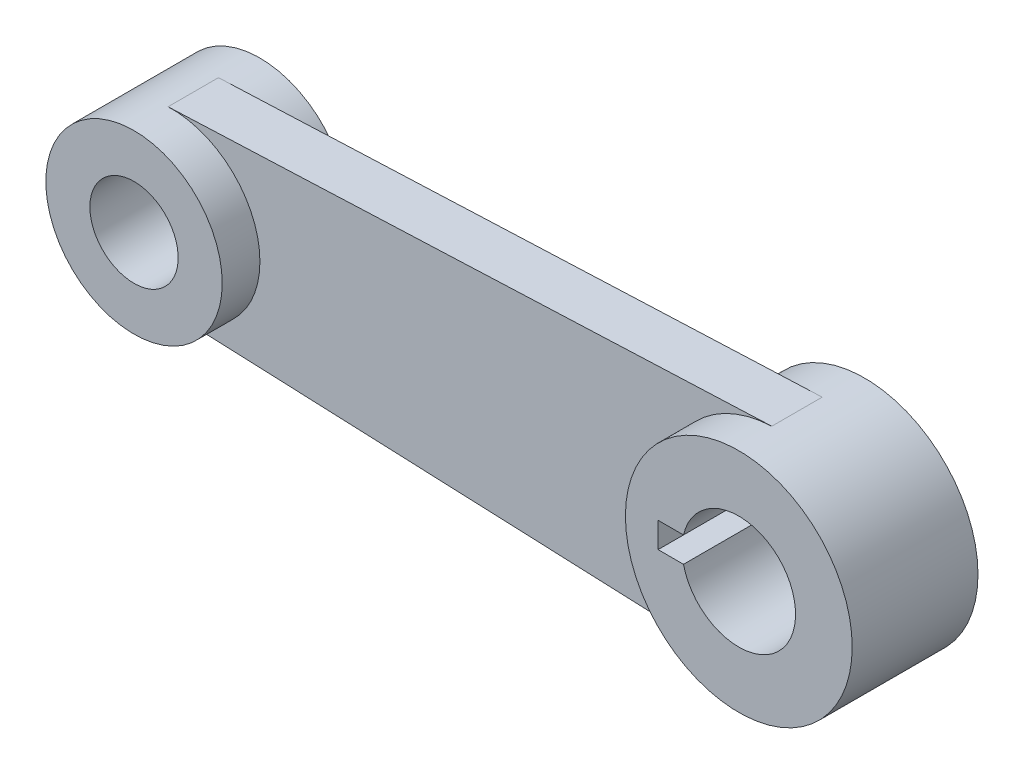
from build123d import *

# Parameters (mm, degrees)
EXTRUDE1_DEPTH = 3.175
EXTRUDE2_START = -7.9248
SKETCH1_3_R    = 14.2875
SKETCH1_3_R_2  = 11.1125
SKETCH1_3_R_3  = 5.5626
EXTRUDE2_DEPTH = 15.8496


with BuildPart() as part:
    # Sketch1 → Extrude1 (new, symmetric)
    with BuildSketch(Plane(origin=(0, 0, 0), x_dir=(-1, 0, 0), z_dir=(0, 0, -1))):
        with BuildLine():
            Line((65.0875, 0), (14.2875, 0))
            ThreePointArc((14.2875, 0), (10.311114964, -9.890074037), (0.5953125, -14.275092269))
            Line((0.5953125, -14.275092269), (76.663020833, -11.102849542))
            ThreePointArc((76.663020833, -11.102849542), (68.507720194, -8.019756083), (65.0875, 0))
        make_face()
        with BuildLine():
            ThreePointArc((0.5953125, 14.275092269), (10.311114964, 9.890074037), (14.2875, 0))
            Line((14.2875, 0), (65.0875, 0))
            ThreePointArc((65.0875, 0), (68.507720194, 8.019756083), (76.663020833, 11.102849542))
            Line((76.663020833, 11.102849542), (0.5953125, 14.275092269))
        make_face()
    extrude(amount=EXTRUDE1_DEPTH, both=True)

    # Sketch1_3 → Extrude2 (add)
    # profile 1 of 2: a face of its own
    with BuildSketch(Plane(origin=(0, 0, 0), x_dir=(-1, 0, 0), z_dir=(0, 0, -1)).offset(EXTRUDE2_START)):
        with Locations(Location((0, 0, 0), (0, 0, 180))):
            Circle(SKETCH1_3_R)
        with BuildLine():
            Line((6.968736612, 1.6002), (10.169136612, 1.6002))
            Line((10.169136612, 1.6002), (10.169136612, -1.6002))
            Line((10.169136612, -1.6002), (6.968736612, -1.6002))
            ThreePointArc((6.968736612, -1.6002), (-7.1501, 0), (6.968736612, 1.6002))
        make_face(mode=Mode.SUBTRACT)
    # profile 2 of 2: a face of its own
    with BuildSketch(Plane(origin=(0, 0, 0), x_dir=(-1, 0, 0), z_dir=(0, 0, -1)).offset(EXTRUDE2_START)):
        with Locations(Location((76.2, 0, 0), (0, 0, 180))):
            Circle(SKETCH1_3_R_2)
        with Locations((76.2, 0)):
            Circle(SKETCH1_3_R_3, mode=Mode.SUBTRACT)
    extrude(amount=EXTRUDE2_DEPTH)


solid = part.part
